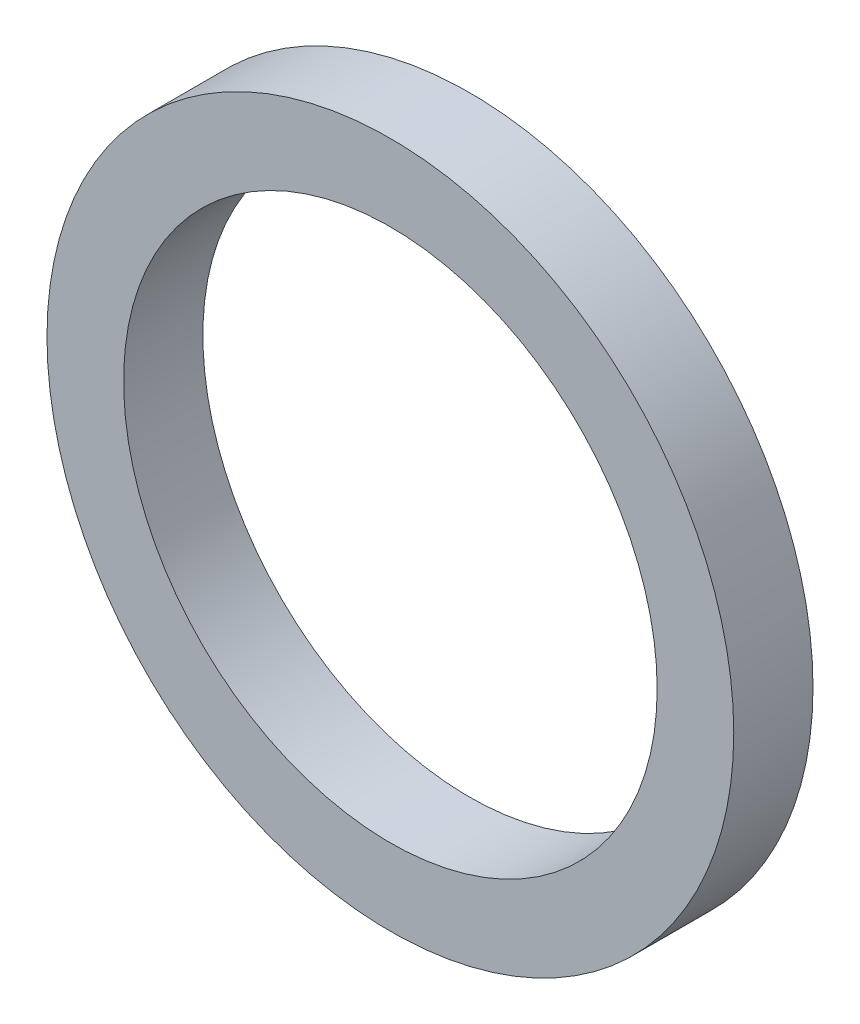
ISO-10303-21;
HEADER;
FILE_DESCRIPTION(('STEP AP214'),'2;1');
FILE_NAME('part.step','',(''),(''),'','','');
FILE_SCHEMA(('AUTOMOTIVE_DESIGN { 1 0 10303 214 1 1 1 1 }'));
ENDSEC;
DATA;
#1=APPLICATION_CONTEXT('core data for automotive mechanical design processes');
#2=APPLICATION_PROTOCOL_DEFINITION('international standard','automotive_design',2000,#1);
#3=PRODUCT_CONTEXT('',#1,'mechanical');
#4=PRODUCT('Part','Part','',(#3));
#5=PRODUCT_RELATED_PRODUCT_CATEGORY('part','',(#4));
#6=PRODUCT_DEFINITION_FORMATION('','',#4);
#7=PRODUCT_DEFINITION_CONTEXT('part definition',#1,'design');
#8=PRODUCT_DEFINITION('design','',#6,#7);
#9=PRODUCT_DEFINITION_SHAPE('','',#8);
#10=(LENGTH_UNIT() NAMED_UNIT(*) SI_UNIT(.MILLI.,.METRE.));
#11=(NAMED_UNIT(*) PLANE_ANGLE_UNIT() SI_UNIT($,.RADIAN.));
#12=(NAMED_UNIT(*) SI_UNIT($,.STERADIAN.) SOLID_ANGLE_UNIT());
#13=UNCERTAINTY_MEASURE_WITH_UNIT(LENGTH_MEASURE(1.E-05),#10,'distance_accuracy_value','');
#14=(GEOMETRIC_REPRESENTATION_CONTEXT(3) GLOBAL_UNCERTAINTY_ASSIGNED_CONTEXT((#13)) GLOBAL_UNIT_ASSIGNED_CONTEXT((#10,
#11,#12)) REPRESENTATION_CONTEXT('',''));
#15=CARTESIAN_POINT('',(0.,0.,0.));
#16=DIRECTION('',(0.,0.,1.));
#17=DIRECTION('',(1.,0.,0.));
#18=AXIS2_PLACEMENT_3D('',#15,#16,#17);
#19=CARTESIAN_POINT('',(0.,0.,-1.5));
#20=DIRECTION('',(0.,0.,1.));
#21=DIRECTION('',(1.,0.,0.));
#22=AXIS2_PLACEMENT_3D('',#19,#20,#21);
#23=CYLINDRICAL_SURFACE('',#22,13.);
#24=CARTESIAN_POINT('',(0.,0.,-1.5));
#25=DIRECTION('',(0.,0.,1.));
#26=DIRECTION('',(1.,0.,0.));
#27=AXIS2_PLACEMENT_3D('',#24,#25,#26);
#28=CIRCLE('',#27,13.);
#29=CARTESIAN_POINT('',(13.,0.,-1.5));
#30=VERTEX_POINT('',#29);
#31=EDGE_CURVE('E10',#30,#30,#28,.T.);
#32=ORIENTED_EDGE('',*,*,#31,.T.);
#33=EDGE_LOOP('',(#32));
#34=FACE_BOUND('',#33,.T.);
#35=CARTESIAN_POINT('',(0.,0.,1.5));
#36=DIRECTION('',(0.,0.,1.));
#37=DIRECTION('',(1.,0.,0.));
#38=AXIS2_PLACEMENT_3D('',#35,#36,#37);
#39=CIRCLE('',#38,13.);
#40=CARTESIAN_POINT('',(13.,0.,1.5));
#41=VERTEX_POINT('',#40);
#42=EDGE_CURVE('E42',#41,#41,#39,.T.);
#43=ORIENTED_EDGE('',*,*,#42,.F.);
#44=EDGE_LOOP('',(#43));
#45=FACE_BOUND('',#44,.T.);
#46=ADVANCED_FACE('F39',(#34,#45),#23,.T.);
#47=CARTESIAN_POINT('',(0.,0.,-1.5));
#48=DIRECTION('',(0.,0.,1.));
#49=DIRECTION('',(1.,0.,0.));
#50=AXIS2_PLACEMENT_3D('',#47,#48,#49);
#51=PLANE('',#50);
#52=CARTESIAN_POINT('',(0.,0.,-1.5));
#53=DIRECTION('',(0.,0.,1.));
#54=DIRECTION('',(1.,0.,0.));
#55=AXIS2_PLACEMENT_3D('',#52,#53,#54);
#56=CIRCLE('',#55,10.1);
#57=CARTESIAN_POINT('',(10.1,0.,-1.5));
#58=VERTEX_POINT('',#57);
#59=EDGE_CURVE('E49',#58,#58,#56,.T.);
#60=ORIENTED_EDGE('',*,*,#59,.T.);
#61=EDGE_LOOP('',(#60));
#62=FACE_BOUND('',#61,.T.);
#63=ORIENTED_EDGE('',*,*,#31,.F.);
#64=EDGE_LOOP('',(#63));
#65=FACE_BOUND('',#64,.T.);
#66=ADVANCED_FACE('F57',(#62,#65),#51,.F.);
#67=CARTESIAN_POINT('',(0.,0.,1.5));
#68=DIRECTION('',(0.,0.,1.));
#69=DIRECTION('',(1.,0.,0.));
#70=AXIS2_PLACEMENT_3D('',#67,#68,#69);
#71=PLANE('',#70);
#72=CARTESIAN_POINT('',(0.,0.,1.5));
#73=DIRECTION('',(0.,0.,1.));
#74=DIRECTION('',(1.,0.,0.));
#75=AXIS2_PLACEMENT_3D('',#72,#73,#74);
#76=CIRCLE('',#75,10.1);
#77=CARTESIAN_POINT('',(10.1,0.,1.5));
#78=VERTEX_POINT('',#77);
#79=EDGE_CURVE('E51',#78,#78,#76,.T.);
#80=ORIENTED_EDGE('',*,*,#79,.F.);
#81=EDGE_LOOP('',(#80));
#82=FACE_BOUND('',#81,.T.);
#83=ORIENTED_EDGE('',*,*,#42,.T.);
#84=EDGE_LOOP('',(#83));
#85=FACE_BOUND('',#84,.T.);
#86=ADVANCED_FACE('F63',(#82,#85),#71,.T.);
#87=CARTESIAN_POINT('',(0.,0.,-1.5));
#88=DIRECTION('',(0.,0.,1.));
#89=DIRECTION('',(1.,0.,0.));
#90=AXIS2_PLACEMENT_3D('',#87,#88,#89);
#91=CYLINDRICAL_SURFACE('',#90,10.1);
#92=ORIENTED_EDGE('',*,*,#59,.F.);
#93=EDGE_LOOP('',(#92));
#94=FACE_BOUND('',#93,.T.);
#95=ORIENTED_EDGE('',*,*,#79,.T.);
#96=EDGE_LOOP('',(#95));
#97=FACE_BOUND('',#96,.T.);
#98=ADVANCED_FACE('F60',(#94,#97),#91,.F.);
#99=CLOSED_SHELL('',(#46,#66,#86,#98));
#100=MANIFOLD_SOLID_BREP('B2',#99);
#101=ADVANCED_BREP_SHAPE_REPRESENTATION('',(#18,#100),#14);
#102=SHAPE_DEFINITION_REPRESENTATION(#9,#101);
ENDSEC;
END-ISO-10303-21;
